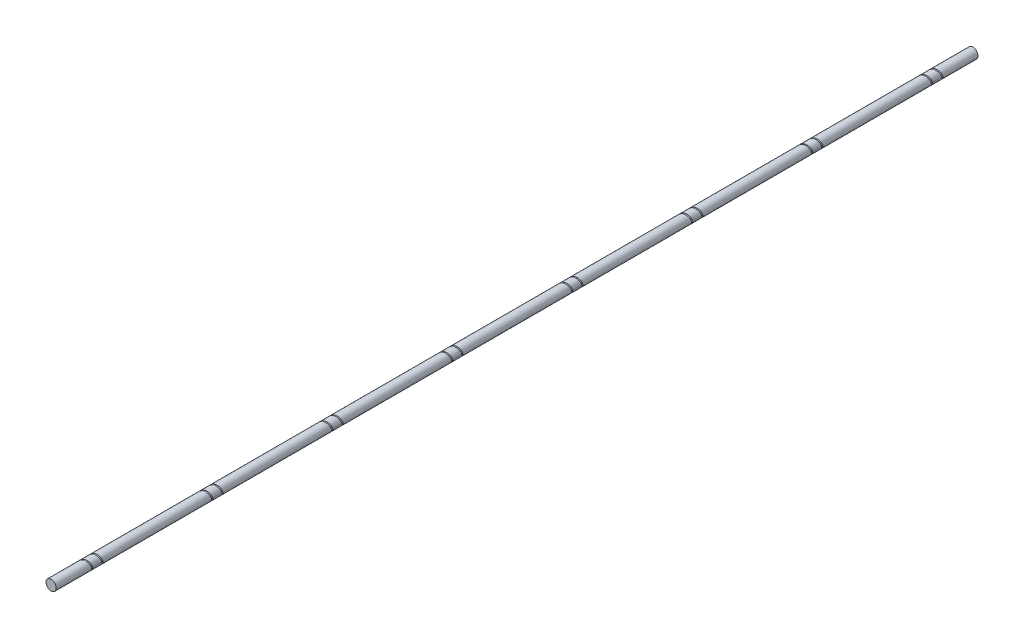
from build123d import *

# Parameters (mm, degrees)
SKETCH1_R              = 25
BOSS_EXTRUDE1_DEPTH    = 4500
CUT_SWEEP1_PITCH       = 50
CUT_SWEEP1_HEIGHT      = 100
CUT_SWEEP1_RADIUS      = 27.646
CUT_SWEEP1_START_ANGLE = -180
SKETCH3_R              = 3.969
LPATTERN1_COUNT        = 8
LPATTERN1_PITCH        = 585.714285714


with BuildPart() as part:
    # Sketch1 → Boss-Extrude1 (new body)
    with BuildSketch(Plane.XY):
        Circle(SKETCH1_R)
    extrude(amount=BOSS_EXTRUDE1_DEPTH)

    # Cut-Sweep1: sweep along a helix
    with BuildLine() as cut_sweep1_path:
        add(Helix(CUT_SWEEP1_PITCH, CUT_SWEEP1_HEIGHT, CUT_SWEEP1_RADIUS, center=(0, 0, 150), direction=(0, 0, 1), mode=Mode.PRIVATE).rotate(Axis((0, 0, 150), (0, 0, 1)), CUT_SWEEP1_START_ANGLE))
    # Sketch3 → Cut-Sweep1 (sweep, cut)
    with BuildSketch(Plane(origin=(0, 0, 0), x_dir=(1, 0, 0), z_dir=(0, 1, 0))):
        with Locations((-27.646, -150)):
            Circle(SKETCH3_R)
    cut_sweep1 = sweep(path=cut_sweep1_path.line, is_frenet=True, mode=Mode.SUBTRACT)

    # LPattern1: Cut-Sweep1 ×8
    with Locations(*[(0, 0, i * LPATTERN1_PITCH) for i in range(1, LPATTERN1_COUNT)]):
        add(cut_sweep1, mode=Mode.SUBTRACT)


solid = part.part
